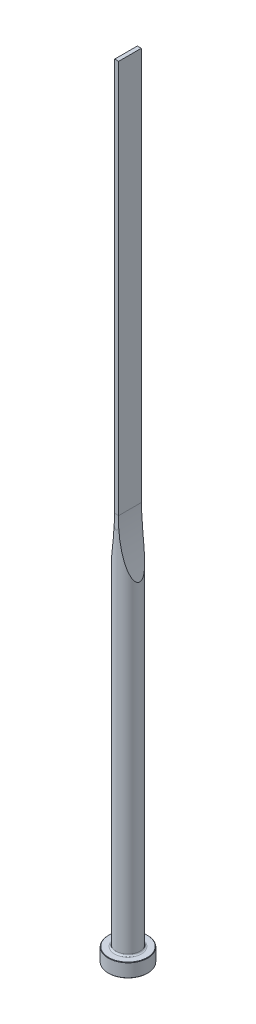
from build123d import *

# Parameters (mm, degrees)
CUT_EXTRUDE1_DEPTH = 7.5
CUT_EXTRUDE2_DEPTH = 7.5


with BuildPart() as part:
    # Sketch1 → Revolve1 (revolve)
    with BuildSketch(Plane.XY, mode=Mode.PRIVATE) as revolve1_sk:
        with BuildLine():
            Line((0, 0), (9.8, 0))
            Line((9.8, 0), (10, 0.2))
            Line((10, 0.2), (10, 6.8))
            Line((10, 6.8), (9.8, 7))
            Line((9.8, 7), (6.8, 7))
            ThreePointArc((6.8, 7), (6.234314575, 7.234314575), (6, 7.8))
            Line((6, 7.8), (6, 400))
            Line((6, 400), (0, 400))
            Line((0, 400), (0, 0))
        make_face()
    revolve(revolve1_sk.sketch.rotate(Axis((0, 400, 0), (0, -1, 0)), 180), axis=Axis((0, 400, 0), (0, -1, 0)))

    # Sketch2 → Cut-Extrude1 (cut, symmetric)
    with BuildSketch(Plane.XY):
        with BuildLine():
            Line((1, 400), (1, 200))
            ThreePointArc((1, 200), (2.258803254, 185), (6, 170.419601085))
            Line((6, 170.419601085), (6, 400))
            Line((6, 400), (1, 400))
        make_face()
        with BuildLine():
            Line((-1, 400), (-1, 200))
            ThreePointArc((-1, 200), (-2.258803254, 185), (-6, 170.419601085))
            Line((-6, 170.419601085), (-6, 400))
            Line((-6, 400), (-1, 400))
        make_face()
    extrude(amount=CUT_EXTRUDE1_DEPTH, both=True, mode=Mode.SUBTRACT)

    # Sketch3 → Cut-Extrude2 (cut, symmetric)
    with BuildSketch(Plane(origin=(0, 0, 0), x_dir=(0, 0, -1), z_dir=(1, 0, 0))):
        with BuildLine():
            Line((5.75, 400), (5.75, 200))
            ThreePointArc((5.75, 200), (5.812521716, 196.645898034), (6, 193.296456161))
            Line((6, 193.296456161), (6, 400))
            Line((6, 400), (5.75, 400))
        make_face()
        with BuildLine():
            Line((-5.75, 400), (-5.75, 200))
            ThreePointArc((-5.75, 200), (-5.812521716, 196.645898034), (-6, 193.296456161))
            Line((-6, 193.296456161), (-6, 400))
            Line((-6, 400), (-5.75, 400))
        make_face()
    extrude(amount=CUT_EXTRUDE2_DEPTH, both=True, mode=Mode.SUBTRACT)


solid = part.part
